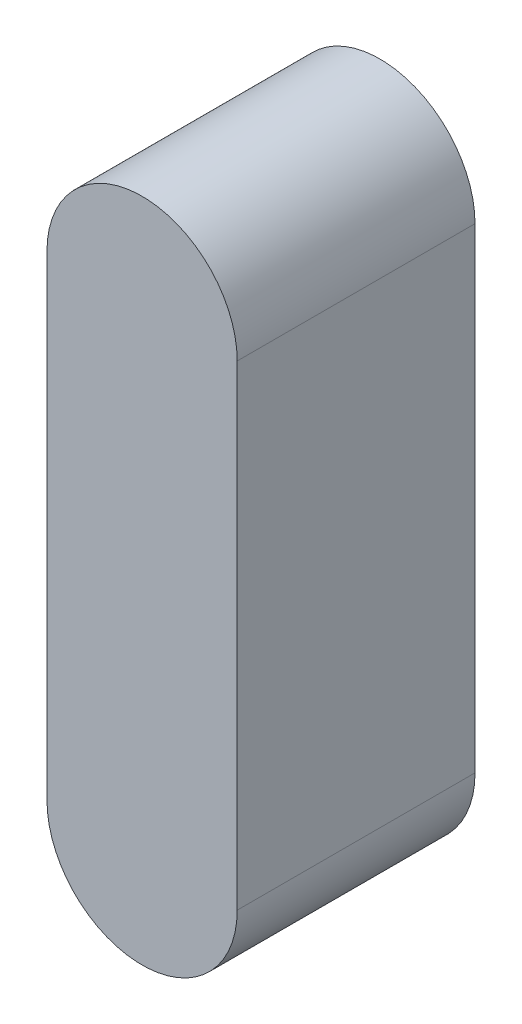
from build123d import *

# Parameters (mm, degrees)
EXTRUDE_1_DEPTH = 5


with BuildPart() as part:
    # Sketch 2 → Extrude 1 (new body)
    with BuildSketch(Plane.XY):
        with BuildLine():
            Line((2, 78), (2, 88))
            ThreePointArc((2, 88), (0, 90), (-2, 88))
            Line((-2, 88), (-2, 78))
            ThreePointArc((-2, 78), (0, 76), (2, 78))
        make_face()
    extrude(amount=EXTRUDE_1_DEPTH)


solid = part.part
